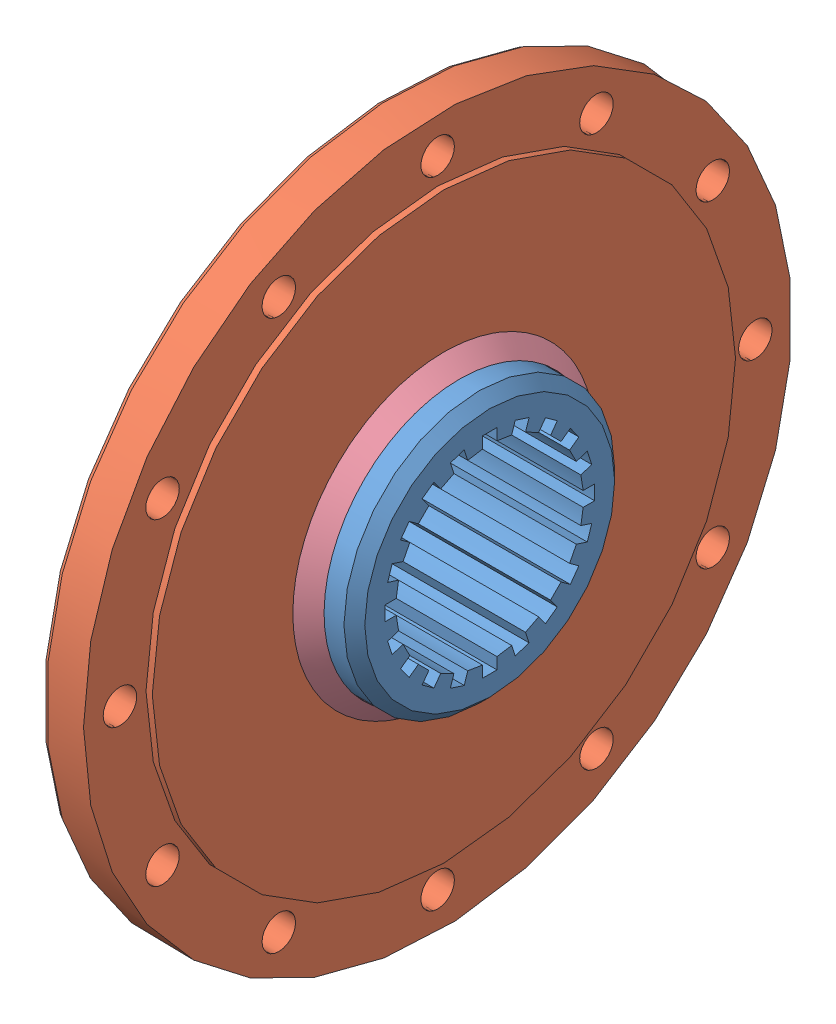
SolidWorks assembly 126 MOYEU.SLDASM, configuration Défaut (file format 3100). Lengths in mm.
Overall size (90 340 340).
4 component instances, 4 part files, 2 mates.
Components (placement in the parent):
- 126A-1: 126A.SLDPRT [Défaut] at (-52.2997 -11.515 0) size (90 140 140)
- 126B-1: 126B.SLDPRT [Défaut] at (-9.2997 -11.515 0) size (25 340 340)
- bead3-1: bead3.sldprt [Défaut] at origin size (11.45 163.3 163.25)
- bead4-1: bead4.sldprt [Défaut] at origin size (11.16 153 152.29)
Mates (geometry in assembly coordinates):
- Coïncidente1: coincident anti-aligned: plane of 126A-1 through (-9.2997 53.485 0) normal (1 0 0); plane of 126B-1 through (-9.2997 53.485 0) normal (-1 0 0)
- Coaxiale1: concentric aligned: cylinder of 126A-1; cylinder of 126B-1
